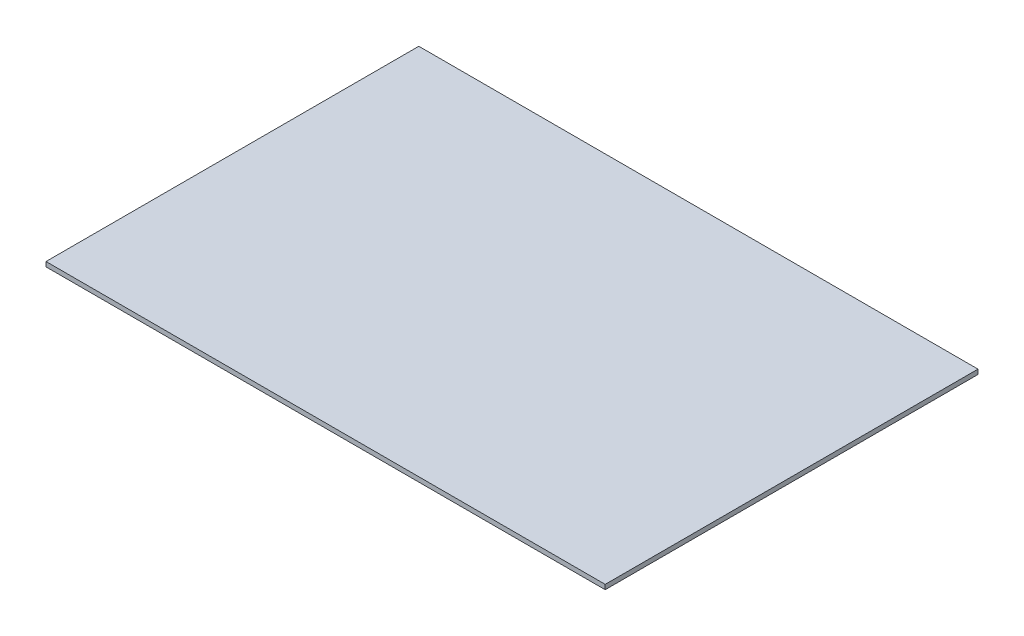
from build123d import *

# Parameters (mm, degrees)
SKETCH1_W           = 762
SKETCH1_H           = 508
BOSS_EXTRUDE1_DEPTH = 6.35


with BuildPart() as part:
    # Sketch1 → Boss-Extrude1 (new body)
    with BuildSketch(Plane(origin=(0, 0, 0), x_dir=(1, 0, 0), z_dir=(0, 1, 0))):
        Rectangle(SKETCH1_W, SKETCH1_H)
    extrude(amount=BOSS_EXTRUDE1_DEPTH)


solid = part.part
